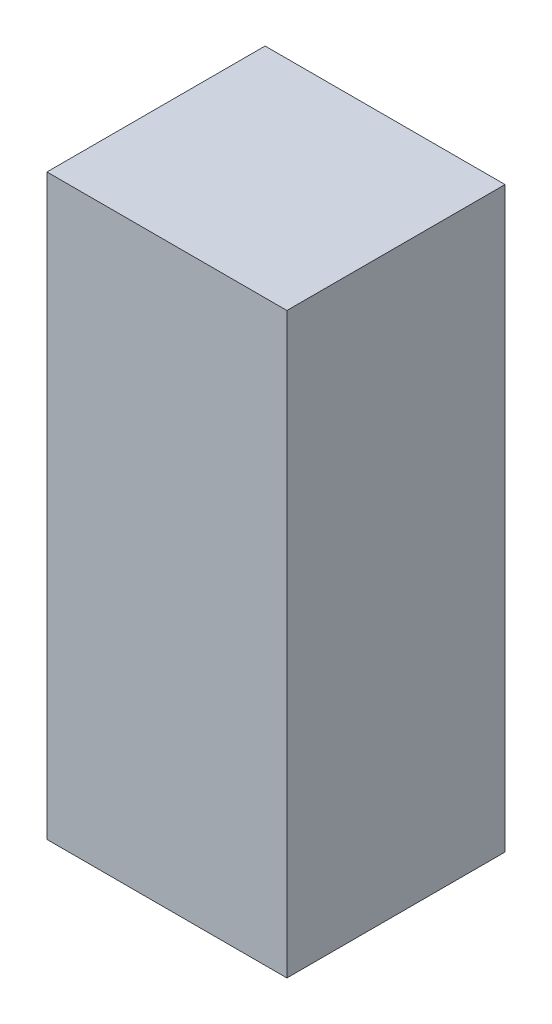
ISO-10303-21;
HEADER;
FILE_DESCRIPTION(('STEP AP214'),'2;1');
FILE_NAME('part.step','',(''),(''),'','','');
FILE_SCHEMA(('AUTOMOTIVE_DESIGN { 1 0 10303 214 1 1 1 1 }'));
ENDSEC;
DATA;
#1=APPLICATION_CONTEXT('core data for automotive mechanical design processes');
#2=APPLICATION_PROTOCOL_DEFINITION('international standard','automotive_design',2000,#1);
#3=PRODUCT_CONTEXT('',#1,'mechanical');
#4=PRODUCT('Part','Part','',(#3));
#5=PRODUCT_RELATED_PRODUCT_CATEGORY('part','',(#4));
#6=PRODUCT_DEFINITION_FORMATION('','',#4);
#7=PRODUCT_DEFINITION_CONTEXT('part definition',#1,'design');
#8=PRODUCT_DEFINITION('design','',#6,#7);
#9=PRODUCT_DEFINITION_SHAPE('','',#8);
#10=(LENGTH_UNIT() NAMED_UNIT(*) SI_UNIT(.MILLI.,.METRE.));
#11=(NAMED_UNIT(*) PLANE_ANGLE_UNIT() SI_UNIT($,.RADIAN.));
#12=(NAMED_UNIT(*) SI_UNIT($,.STERADIAN.) SOLID_ANGLE_UNIT());
#13=UNCERTAINTY_MEASURE_WITH_UNIT(LENGTH_MEASURE(1.E-05),#10,'distance_accuracy_value','');
#14=(GEOMETRIC_REPRESENTATION_CONTEXT(3) GLOBAL_UNCERTAINTY_ASSIGNED_CONTEXT((#13)) GLOBAL_UNIT_ASSIGNED_CONTEXT((#10,
#11,#12)) REPRESENTATION_CONTEXT('',''));
#15=CARTESIAN_POINT('',(0.,0.,0.));
#16=DIRECTION('',(0.,0.,1.));
#17=DIRECTION('',(1.,0.,0.));
#18=AXIS2_PLACEMENT_3D('',#15,#16,#17);
#19=CARTESIAN_POINT('',(43.1465092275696,-60.7212863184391,2.));
#20=DIRECTION('',(-1.,0.,0.));
#21=DIRECTION('',(0.,0.,1.));
#22=AXIS2_PLACEMENT_3D('',#19,#20,#21);
#23=PLANE('',#22);
#24=DIRECTION('',(0.,1.,0.));
#25=VECTOR('',#24,1.);
#26=CARTESIAN_POINT('',(43.1465092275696,-60.7212863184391,0.));
#27=LINE('',#26,#25);
#28=CARTESIAN_POINT('',(43.1465092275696,-60.7212863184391,0.));
#29=VERTEX_POINT('',#28);
#30=CARTESIAN_POINT('',(43.1465092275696,-55.4212863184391,0.));
#31=VERTEX_POINT('',#30);
#32=EDGE_CURVE('E74',#29,#31,#27,.T.);
#33=ORIENTED_EDGE('',*,*,#32,.T.);
#34=DIRECTION('',(0.,0.,-1.));
#35=VECTOR('',#34,1.);
#36=CARTESIAN_POINT('',(43.1465092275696,-55.4212863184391,2.));
#37=LINE('',#36,#35);
#38=CARTESIAN_POINT('',(43.1465092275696,-55.4212863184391,2.));
#39=VERTEX_POINT('',#38);
#40=EDGE_CURVE('E11',#39,#31,#37,.T.);
#41=ORIENTED_EDGE('',*,*,#40,.F.);
#42=DIRECTION('',(0.,1.,0.));
#43=VECTOR('',#42,1.);
#44=CARTESIAN_POINT('',(43.1465092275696,-60.7212863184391,2.));
#45=LINE('',#44,#43);
#46=CARTESIAN_POINT('',(43.1465092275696,-60.7212863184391,2.));
#47=VERTEX_POINT('',#46);
#48=EDGE_CURVE('E92',#47,#39,#45,.T.);
#49=ORIENTED_EDGE('',*,*,#48,.F.);
#50=DIRECTION('',(0.,0.,-1.));
#51=VECTOR('',#50,1.);
#52=CARTESIAN_POINT('',(43.1465092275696,-60.7212863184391,2.));
#53=LINE('',#52,#51);
#54=EDGE_CURVE('E86',#47,#29,#53,.T.);
#55=ORIENTED_EDGE('',*,*,#54,.T.);
#56=EDGE_LOOP('',(#33,#41,#49,#55));
#57=FACE_BOUND('',#56,.T.);
#58=ADVANCED_FACE('F30',(#57),#23,.F.);
#59=CARTESIAN_POINT('',(43.1465092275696,-55.4212863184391,2.));
#60=DIRECTION('',(0.,-1.,0.));
#61=DIRECTION('',(0.,0.,-1.));
#62=AXIS2_PLACEMENT_3D('',#59,#60,#61);
#63=PLANE('',#62);
#64=DIRECTION('',(-1.,0.,0.));
#65=VECTOR('',#64,1.);
#66=CARTESIAN_POINT('',(43.1465092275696,-55.4212863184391,0.));
#67=LINE('',#66,#65);
#68=CARTESIAN_POINT('',(40.9465092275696,-55.4212863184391,0.));
#69=VERTEX_POINT('',#68);
#70=EDGE_CURVE('E70',#31,#69,#67,.T.);
#71=ORIENTED_EDGE('',*,*,#70,.T.);
#72=DIRECTION('',(0.,0.,-1.));
#73=VECTOR('',#72,1.);
#74=CARTESIAN_POINT('',(40.9465092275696,-55.4212863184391,2.));
#75=LINE('',#74,#73);
#76=CARTESIAN_POINT('',(40.9465092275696,-55.4212863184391,2.));
#77=VERTEX_POINT('',#76);
#78=EDGE_CURVE('E37',#77,#69,#75,.T.);
#79=ORIENTED_EDGE('',*,*,#78,.F.);
#80=DIRECTION('',(-1.,0.,0.));
#81=VECTOR('',#80,1.);
#82=CARTESIAN_POINT('',(43.1465092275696,-55.4212863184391,2.));
#83=LINE('',#82,#81);
#84=EDGE_CURVE('E82',#39,#77,#83,.T.);
#85=ORIENTED_EDGE('',*,*,#84,.F.);
#86=ORIENTED_EDGE('',*,*,#40,.T.);
#87=EDGE_LOOP('',(#71,#79,#85,#86));
#88=FACE_BOUND('',#87,.T.);
#89=ADVANCED_FACE('F81',(#88),#63,.F.);
#90=CARTESIAN_POINT('',(40.9465092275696,-55.4212863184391,2.));
#91=DIRECTION('',(1.,0.,0.));
#92=DIRECTION('',(0.,1.,0.));
#93=AXIS2_PLACEMENT_3D('',#90,#91,#92);
#94=PLANE('',#93);
#95=DIRECTION('',(0.,-1.,0.));
#96=VECTOR('',#95,1.);
#97=CARTESIAN_POINT('',(40.9465092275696,-55.4212863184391,0.));
#98=LINE('',#97,#96);
#99=CARTESIAN_POINT('',(40.9465092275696,-60.7212863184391,0.));
#100=VERTEX_POINT('',#99);
#101=EDGE_CURVE('E75',#69,#100,#98,.T.);
#102=ORIENTED_EDGE('',*,*,#101,.T.);
#103=DIRECTION('',(0.,0.,-1.));
#104=VECTOR('',#103,1.);
#105=CARTESIAN_POINT('',(40.9465092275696,-60.7212863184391,2.));
#106=LINE('',#105,#104);
#107=CARTESIAN_POINT('',(40.9465092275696,-60.7212863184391,2.));
#108=VERTEX_POINT('',#107);
#109=EDGE_CURVE('E98',#108,#100,#106,.T.);
#110=ORIENTED_EDGE('',*,*,#109,.F.);
#111=DIRECTION('',(0.,-1.,0.));
#112=VECTOR('',#111,1.);
#113=CARTESIAN_POINT('',(40.9465092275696,-55.4212863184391,2.));
#114=LINE('',#113,#112);
#115=EDGE_CURVE('E49',#77,#108,#114,.T.);
#116=ORIENTED_EDGE('',*,*,#115,.F.);
#117=ORIENTED_EDGE('',*,*,#78,.T.);
#118=EDGE_LOOP('',(#102,#110,#116,#117));
#119=FACE_BOUND('',#118,.T.);
#120=ADVANCED_FACE('F101',(#119),#94,.F.);
#121=CARTESIAN_POINT('',(40.9465092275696,-60.7212863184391,2.));
#122=DIRECTION('',(0.,1.,0.));
#123=DIRECTION('',(0.,0.,1.));
#124=AXIS2_PLACEMENT_3D('',#121,#122,#123);
#125=PLANE('',#124);
#126=DIRECTION('',(1.,0.,0.));
#127=VECTOR('',#126,1.);
#128=CARTESIAN_POINT('',(40.9465092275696,-60.7212863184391,0.));
#129=LINE('',#128,#127);
#130=EDGE_CURVE('E90',#100,#29,#129,.T.);
#131=ORIENTED_EDGE('',*,*,#130,.T.);
#132=ORIENTED_EDGE('',*,*,#54,.F.);
#133=DIRECTION('',(1.,0.,0.));
#134=VECTOR('',#133,1.);
#135=CARTESIAN_POINT('',(40.9465092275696,-60.7212863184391,2.));
#136=LINE('',#135,#134);
#137=EDGE_CURVE('E44',#108,#47,#136,.T.);
#138=ORIENTED_EDGE('',*,*,#137,.F.);
#139=ORIENTED_EDGE('',*,*,#109,.T.);
#140=EDGE_LOOP('',(#131,#132,#138,#139));
#141=FACE_BOUND('',#140,.T.);
#142=ADVANCED_FACE('F103',(#141),#125,.F.);
#143=CARTESIAN_POINT('',(43.1465092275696,-55.4212863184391,2.));
#144=DIRECTION('',(0.,0.,1.));
#145=DIRECTION('',(1.,0.,0.));
#146=AXIS2_PLACEMENT_3D('',#143,#144,#145);
#147=PLANE('',#146);
#148=ORIENTED_EDGE('',*,*,#48,.T.);
#149=ORIENTED_EDGE('',*,*,#84,.T.);
#150=ORIENTED_EDGE('',*,*,#115,.T.);
#151=ORIENTED_EDGE('',*,*,#137,.T.);
#152=EDGE_LOOP('',(#148,#149,#150,#151));
#153=FACE_BOUND('',#152,.T.);
#154=ADVANCED_FACE('F104',(#153),#147,.T.);
#155=CARTESIAN_POINT('',(43.1465092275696,-55.4212863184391,0.));
#156=DIRECTION('',(0.,0.,1.));
#157=DIRECTION('',(1.,0.,0.));
#158=AXIS2_PLACEMENT_3D('',#155,#156,#157);
#159=PLANE('',#158);
#160=ORIENTED_EDGE('',*,*,#32,.F.);
#161=ORIENTED_EDGE('',*,*,#130,.F.);
#162=ORIENTED_EDGE('',*,*,#101,.F.);
#163=ORIENTED_EDGE('',*,*,#70,.F.);
#164=EDGE_LOOP('',(#160,#161,#162,#163));
#165=FACE_BOUND('',#164,.T.);
#166=ADVANCED_FACE('F71',(#165),#159,.F.);
#167=CLOSED_SHELL('',(#58,#89,#120,#142,#154,#166));
#168=MANIFOLD_SOLID_BREP('B2',#167);
#169=ADVANCED_BREP_SHAPE_REPRESENTATION('',(#18,#168),#14);
#170=SHAPE_DEFINITION_REPRESENTATION(#9,#169);
ENDSEC;
END-ISO-10303-21;
